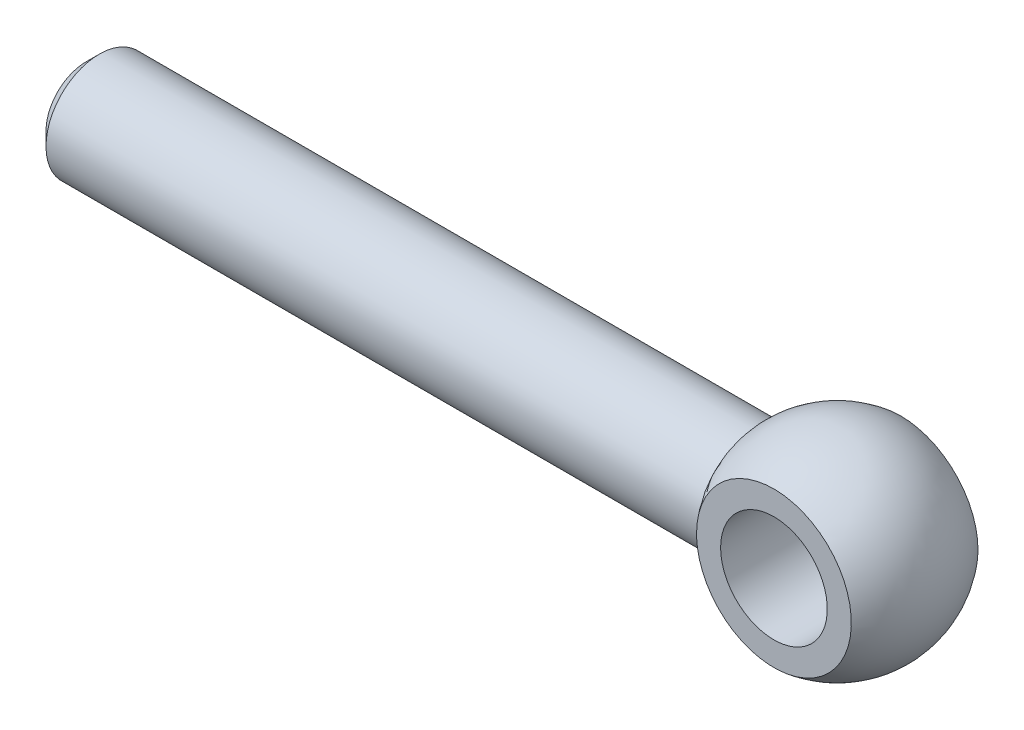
ISO-10303-21;
HEADER;
FILE_DESCRIPTION(('STEP AP214'),'2;1');
FILE_NAME('part.step','',(''),(''),'','','');
FILE_SCHEMA(('AUTOMOTIVE_DESIGN { 1 0 10303 214 1 1 1 1 }'));
ENDSEC;
DATA;
#1=APPLICATION_CONTEXT('core data for automotive mechanical design processes');
#2=APPLICATION_PROTOCOL_DEFINITION('international standard','automotive_design',2000,#1);
#3=PRODUCT_CONTEXT('',#1,'mechanical');
#4=PRODUCT('Part','Part','',(#3));
#5=PRODUCT_RELATED_PRODUCT_CATEGORY('part','',(#4));
#6=PRODUCT_DEFINITION_FORMATION('','',#4);
#7=PRODUCT_DEFINITION_CONTEXT('part definition',#1,'design');
#8=PRODUCT_DEFINITION('design','',#6,#7);
#9=PRODUCT_DEFINITION_SHAPE('','',#8);
#10=(LENGTH_UNIT() NAMED_UNIT(*) SI_UNIT(.MILLI.,.METRE.));
#11=(NAMED_UNIT(*) PLANE_ANGLE_UNIT() SI_UNIT($,.RADIAN.));
#12=(NAMED_UNIT(*) SI_UNIT($,.STERADIAN.) SOLID_ANGLE_UNIT());
#13=UNCERTAINTY_MEASURE_WITH_UNIT(LENGTH_MEASURE(1.E-05),#10,'distance_accuracy_value','');
#14=(GEOMETRIC_REPRESENTATION_CONTEXT(3) GLOBAL_UNCERTAINTY_ASSIGNED_CONTEXT((#13)) GLOBAL_UNIT_ASSIGNED_CONTEXT((#10,
#11,#12)) REPRESENTATION_CONTEXT('',''));
#15=CARTESIAN_POINT('',(0.,0.,0.));
#16=DIRECTION('',(0.,0.,1.));
#17=DIRECTION('',(1.,0.,0.));
#18=AXIS2_PLACEMENT_3D('',#15,#16,#17);
#19=CARTESIAN_POINT('',(-5.804093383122,9.,-4.75));
#20=DIRECTION('',(0.,0.,1.));
#21=DIRECTION('',(1.,0.,0.));
#22=AXIS2_PLACEMENT_3D('',#19,#20,#21);
#23=PLANE('',#22);
#24=CARTESIAN_POINT('',(5.80409338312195,0.,-4.75));
#25=CARTESIAN_POINT('',(5.80409248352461,0.16296057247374,-4.74999999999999));
#26=CARTESIAN_POINT('',(5.7972245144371,0.325950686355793,-4.75));
#27=CARTESIAN_POINT('',(5.76979515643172,0.650807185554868,-4.75));
#28=CARTESIAN_POINT('',(5.74922972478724,0.812673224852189,-4.75));
#29=CARTESIAN_POINT('',(5.69450483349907,1.13436026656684,-4.75));
#30=CARTESIAN_POINT('',(5.66032379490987,1.29417760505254,-4.75));
#31=CARTESIAN_POINT('',(5.5785777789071,1.610489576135,-4.75));
#32=CARTESIAN_POINT('',(5.53100194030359,1.76698140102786,-4.74999999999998));
#33=CARTESIAN_POINT('',(5.422910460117,2.07512781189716,-4.74999999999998));
#34=CARTESIAN_POINT('',(5.36241723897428,2.22679026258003,-4.75));
#35=CARTESIAN_POINT('',(5.22884216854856,2.52454893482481,-4.75));
#36=CARTESIAN_POINT('',(5.15575463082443,2.67064260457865,-4.75));
#37=CARTESIAN_POINT('',(4.99752666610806,2.95615745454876,-4.75));
#38=CARTESIAN_POINT('',(4.91238578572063,3.09557838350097,-4.75));
#39=CARTESIAN_POINT('',(4.73069993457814,3.36668884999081,-4.75));
#40=CARTESIAN_POINT('',(4.63416013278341,3.49838185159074,-4.74999999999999));
#41=CARTESIAN_POINT('',(4.43026574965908,3.75325130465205,-4.74999999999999));
#42=CARTESIAN_POINT('',(4.32290422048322,3.87642219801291,-4.75));
#43=CARTESIAN_POINT('',(4.09829087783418,4.11316309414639,-4.75));
#44=CARTESIAN_POINT('',(3.9810486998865,4.22674223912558,-4.75));
#45=CARTESIAN_POINT('',(3.7373622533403,4.44367484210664,-4.75));
#46=CARTESIAN_POINT('',(3.61091384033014,4.54702364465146,-4.75));
#47=CARTESIAN_POINT('',(3.3497304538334,4.7427250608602,-4.75));
#48=CARTESIAN_POINT('',(3.21499356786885,4.83507512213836,-4.75));
#49=CARTESIAN_POINT('',(2.93826469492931,5.00806526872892,-4.75));
#50=CARTESIAN_POINT('',(2.79627517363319,5.08870929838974,-4.75));
#51=CARTESIAN_POINT('',(2.50595468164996,5.23777890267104,-4.75));
#52=CARTESIAN_POINT('',(2.3576213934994,5.30619996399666,-4.75));
#53=CARTESIAN_POINT('',(2.05577501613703,5.43027674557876,-4.75));
#54=CARTESIAN_POINT('',(1.90226392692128,5.48593733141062,-4.75));
#55=CARTESIAN_POINT('',(1.59104081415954,5.58414947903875,-4.75));
#56=CARTESIAN_POINT('',(1.43332723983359,5.62669612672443,-4.75));
#57=CARTESIAN_POINT('',(1.11494114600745,5.69833492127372,-4.75));
#58=CARTESIAN_POINT('',(0.954269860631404,5.7274325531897,-4.75));
#59=CARTESIAN_POINT('',(0.630974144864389,5.7720022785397,-4.75));
#60=CARTESIAN_POINT('',(0.468348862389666,5.78746819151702,-4.75));
#61=CARTESIAN_POINT('',(0.142373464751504,5.80464198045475,-4.75));
#62=CARTESIAN_POINT('',(-0.0209766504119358,5.80634985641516,-4.75));
#63=CARTESIAN_POINT('',(-0.347165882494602,5.79599779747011,-4.75));
#64=CARTESIAN_POINT('',(-0.510005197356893,5.78394409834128,-4.75));
#65=CARTESIAN_POINT('',(-0.834156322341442,5.74615693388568,-4.75));
#66=CARTESIAN_POINT('',(-0.995467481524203,5.72041788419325,-4.75));
#67=CARTESIAN_POINT('',(-1.31528752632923,5.65545180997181,-4.75));
#68=CARTESIAN_POINT('',(-1.47379743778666,5.61622983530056,-4.75));
#69=CARTESIAN_POINT('',(-1.78701043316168,5.52455703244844,-4.75));
#70=CARTESIAN_POINT('',(-1.94171203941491,5.47210115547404,-4.75));
#71=CARTESIAN_POINT('',(-2.24608912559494,5.35436278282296,-4.75));
#72=CARTESIAN_POINT('',(-2.3957664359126,5.28908501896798,-4.75));
#73=CARTESIAN_POINT('',(-2.6891406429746,5.14613035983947,-4.75));
#74=CARTESIAN_POINT('',(-2.83283550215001,5.06844928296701,-4.75));
#75=CARTESIAN_POINT('',(-3.11313671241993,4.90127560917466,-4.75));
#76=CARTESIAN_POINT('',(-3.24974469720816,4.81178575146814,-4.75));
#77=CARTESIAN_POINT('',(-3.51487673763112,4.62165989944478,-4.75));
#78=CARTESIAN_POINT('',(-3.64340442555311,4.521028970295,-4.75));
#79=CARTESIAN_POINT('',(-3.8916503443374,4.30920033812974,-4.75));
#80=CARTESIAN_POINT('',(-4.01135995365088,4.19799253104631,-4.75));
#81=CARTESIAN_POINT('',(-4.24090650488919,3.96595861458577,-4.75));
#82=CARTESIAN_POINT('',(-4.35074977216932,3.84513876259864,-4.75));
#83=CARTESIAN_POINT('',(-4.55991729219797,3.59462013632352,-4.75));
#84=CARTESIAN_POINT('',(-4.65923676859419,3.46491737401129,-4.75));
#85=CARTESIAN_POINT('',(-4.84658983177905,3.19760922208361,-4.75));
#86=CARTESIAN_POINT('',(-4.93462384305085,3.06000412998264,-4.75));
#87=CARTESIAN_POINT('',(-5.09874703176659,2.77792948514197,-4.75));
#88=CARTESIAN_POINT('',(-5.17484159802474,2.63346306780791,-4.75));
#89=CARTESIAN_POINT('',(-5.31471378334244,2.3383804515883,-4.75));
#90=CARTESIAN_POINT('',(-5.3784699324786,2.1877540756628,-4.75));
#91=CARTESIAN_POINT('',(-5.49300051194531,1.88178280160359,-4.75));
#92=CARTESIAN_POINT('',(-5.54378544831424,1.72644183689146,-4.75));
#93=CARTESIAN_POINT('',(-5.63200928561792,1.41228595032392,-4.75));
#94=CARTESIAN_POINT('',(-5.66946926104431,1.25347693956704,-4.75000000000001));
#95=CARTESIAN_POINT('',(-5.73088170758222,0.933301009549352,-4.74999999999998));
#96=CARTESIAN_POINT('',(-5.75483816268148,0.771934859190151,-4.74999999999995));
#97=CARTESIAN_POINT('',(-5.78266423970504,0.508598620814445,-4.74999999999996));
#98=CARTESIAN_POINT('',(-5.79069765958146,0.407050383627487,-4.74999999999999));
#99=CARTESIAN_POINT('',(-5.8014125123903,0.203671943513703,-4.75000000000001));
#100=CARTESIAN_POINT('',(-5.80409394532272,0.101841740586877,-4.75));
#101=CARTESIAN_POINT('',(-5.80409248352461,-0.162960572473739,-4.75));
#102=CARTESIAN_POINT('',(-5.7972245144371,-0.325950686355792,-4.75));
#103=CARTESIAN_POINT('',(-5.76979515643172,-0.650807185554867,-4.75));
#104=CARTESIAN_POINT('',(-5.74922972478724,-0.812673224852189,-4.75));
#105=CARTESIAN_POINT('',(-5.69450483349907,-1.13436026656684,-4.75));
#106=CARTESIAN_POINT('',(-5.66032379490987,-1.29417760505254,-4.75));
#107=CARTESIAN_POINT('',(-5.5785777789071,-1.610489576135,-4.75));
#108=CARTESIAN_POINT('',(-5.5310019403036,-1.76698140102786,-4.74999999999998));
#109=CARTESIAN_POINT('',(-5.42291046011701,-2.07512781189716,-4.74999999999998));
#110=CARTESIAN_POINT('',(-5.36241723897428,-2.22679026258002,-4.75));
#111=CARTESIAN_POINT('',(-5.22884216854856,-2.5245489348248,-4.75));
#112=CARTESIAN_POINT('',(-5.15575463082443,-2.67064260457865,-4.75));
#113=CARTESIAN_POINT('',(-4.99752666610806,-2.95615745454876,-4.75));
#114=CARTESIAN_POINT('',(-4.91238578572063,-3.09557838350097,-4.75));
#115=CARTESIAN_POINT('',(-4.73069993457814,-3.3666888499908,-4.75));
#116=CARTESIAN_POINT('',(-4.63416013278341,-3.49838185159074,-4.74999999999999));
#117=CARTESIAN_POINT('',(-4.43026574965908,-3.75325130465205,-4.74999999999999));
#118=CARTESIAN_POINT('',(-4.32290422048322,-3.87642219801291,-4.75));
#119=CARTESIAN_POINT('',(-4.09829087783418,-4.11316309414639,-4.75));
#120=CARTESIAN_POINT('',(-3.9810486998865,-4.22674223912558,-4.75));
#121=CARTESIAN_POINT('',(-3.7373622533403,-4.44367484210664,-4.75));
#122=CARTESIAN_POINT('',(-3.61091384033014,-4.54702364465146,-4.75));
#123=CARTESIAN_POINT('',(-3.34973045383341,-4.7427250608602,-4.75));
#124=CARTESIAN_POINT('',(-3.21499356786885,-4.83507512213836,-4.75));
#125=CARTESIAN_POINT('',(-2.93826469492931,-5.00806526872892,-4.75));
#126=CARTESIAN_POINT('',(-2.7962751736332,-5.08870929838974,-4.75));
#127=CARTESIAN_POINT('',(-2.50595468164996,-5.23777890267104,-4.75));
#128=CARTESIAN_POINT('',(-2.3576213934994,-5.30619996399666,-4.75));
#129=CARTESIAN_POINT('',(-2.05577501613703,-5.43027674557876,-4.75));
#130=CARTESIAN_POINT('',(-1.90226392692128,-5.48593733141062,-4.75));
#131=CARTESIAN_POINT('',(-1.59104081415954,-5.58414947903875,-4.75));
#132=CARTESIAN_POINT('',(-1.4333272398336,-5.62669612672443,-4.75));
#133=CARTESIAN_POINT('',(-1.11494114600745,-5.69833492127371,-4.75));
#134=CARTESIAN_POINT('',(-0.954269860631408,-5.7274325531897,-4.75));
#135=CARTESIAN_POINT('',(-0.630974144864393,-5.7720022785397,-4.75));
#136=CARTESIAN_POINT('',(-0.46834886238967,-5.78746819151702,-4.75));
#137=CARTESIAN_POINT('',(-0.142373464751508,-5.80464198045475,-4.75));
#138=CARTESIAN_POINT('',(0.0209766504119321,-5.80634985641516,-4.75));
#139=CARTESIAN_POINT('',(0.347165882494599,-5.79599779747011,-4.75));
#140=CARTESIAN_POINT('',(0.510005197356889,-5.78394409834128,-4.75));
#141=CARTESIAN_POINT('',(0.83415632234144,-5.74615693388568,-4.75));
#142=CARTESIAN_POINT('',(0.9954674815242,-5.72041788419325,-4.75));
#143=CARTESIAN_POINT('',(1.31528752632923,-5.65545180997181,-4.75));
#144=CARTESIAN_POINT('',(1.47379743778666,-5.61622983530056,-4.75));
#145=CARTESIAN_POINT('',(1.78701043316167,-5.52455703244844,-4.75));
#146=CARTESIAN_POINT('',(1.94171203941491,-5.47210115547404,-4.75));
#147=CARTESIAN_POINT('',(2.24608912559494,-5.35436278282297,-4.75));
#148=CARTESIAN_POINT('',(2.3957664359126,-5.28908501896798,-4.75));
#149=CARTESIAN_POINT('',(2.6891406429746,-5.14613035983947,-4.75));
#150=CARTESIAN_POINT('',(2.83283550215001,-5.06844928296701,-4.75));
#151=CARTESIAN_POINT('',(3.11313671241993,-4.90127560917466,-4.75));
#152=CARTESIAN_POINT('',(3.24974469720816,-4.81178575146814,-4.75));
#153=CARTESIAN_POINT('',(3.51487673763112,-4.62165989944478,-4.75));
#154=CARTESIAN_POINT('',(3.64340442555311,-4.521028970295,-4.75));
#155=CARTESIAN_POINT('',(3.8916503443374,-4.30920033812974,-4.75));
#156=CARTESIAN_POINT('',(4.01135995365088,-4.19799253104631,-4.75));
#157=CARTESIAN_POINT('',(4.24090650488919,-3.96595861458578,-4.75));
#158=CARTESIAN_POINT('',(4.35074977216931,-3.84513876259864,-4.75));
#159=CARTESIAN_POINT('',(4.55991729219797,-3.59462013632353,-4.75));
#160=CARTESIAN_POINT('',(4.65923676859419,-3.46491737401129,-4.75));
#161=CARTESIAN_POINT('',(4.84658983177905,-3.19760922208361,-4.75));
#162=CARTESIAN_POINT('',(4.93462384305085,-3.06000412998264,-4.75));
#163=CARTESIAN_POINT('',(5.09874703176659,-2.77792948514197,-4.75));
#164=CARTESIAN_POINT('',(5.17484159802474,-2.63346306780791,-4.75));
#165=CARTESIAN_POINT('',(5.31471378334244,-2.33838045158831,-4.75));
#166=CARTESIAN_POINT('',(5.3784699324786,-2.1877540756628,-4.75));
#167=CARTESIAN_POINT('',(5.49300051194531,-1.88178280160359,-4.75));
#168=CARTESIAN_POINT('',(5.54378544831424,-1.72644183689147,-4.75));
#169=CARTESIAN_POINT('',(5.63200928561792,-1.41228595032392,-4.75));
#170=CARTESIAN_POINT('',(5.66946926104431,-1.25347693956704,-4.75000000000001));
#171=CARTESIAN_POINT('',(5.73088170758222,-0.933301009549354,-4.74999999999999));
#172=CARTESIAN_POINT('',(5.75483816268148,-0.771934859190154,-4.74999999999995));
#173=CARTESIAN_POINT('',(5.78266423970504,-0.508598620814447,-4.74999999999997));
#174=CARTESIAN_POINT('',(5.79069765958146,-0.407050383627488,-4.74999999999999));
#175=CARTESIAN_POINT('',(5.8014125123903,-0.203671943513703,-4.75000000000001));
#176=CARTESIAN_POINT('',(5.80409394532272,-0.101841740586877,-4.75));
#177=CARTESIAN_POINT('',(5.80409338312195,0.,-4.75));
#178=B_SPLINE_CURVE_WITH_KNOTS('',3,(#24,#25,#26,#27,#28,#29,#30,#31,#32,#33,#34,#35,#36,#37,
#38,#39,#40,#41,#42,#43,#44,#45,#46,#47,#48,#49,#50,#51,#52,#53,#54,#55,#56,#57,#58,#59,#60,#61,
#62,#63,#64,#65,#66,#67,#68,#69,#70,#71,#72,#73,#74,#75,#76,#77,#78,#79,#80,#81,#82,#83,#84,#85,
#86,#87,#88,#89,#90,#91,#92,#93,#94,#95,#96,#97,#98,#99,#100,#101,#102,#103,#104,#105,#106,#107,
#108,#109,#110,#111,#112,#113,#114,#115,#116,#117,#118,#119,#120,#121,#122,#123,#124,#125,#126,
#127,#128,#129,#130,#131,#132,#133,#134,#135,#136,#137,#138,#139,#140,#141,#142,#143,#144,#145,
#146,#147,#148,#149,#150,#151,#152,#153,#154,#155,#156,#157,#158,#159,#160,#161,#162,#163,#164,
#165,#166,#167,#168,#169,#170,#171,#172,#173,#174,#175,#176,#177),.UNSPECIFIED.,.T.,.F.,(4,2,2,
2,2,2,2,2,2,2,2,2,2,2,2,2,2,2,2,2,2,2,2,2,2,2,2,2,2,2,2,2,2,2,2,2,2,2,2,2,2,2,2,2,2,2,2,2,2,2,2,
2,2,2,2,2,2,2,2,2,2,2,2,2,2,2,2,2,2,2,2,2,2,2,2,2,4),(0.,0.488788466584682,0.97772126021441,
1.46743205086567,1.95754107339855,2.44680623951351,2.93629297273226,3.42579812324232,
3.91508214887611,4.4046823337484,4.89381047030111,5.38316017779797,5.87262322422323,
6.36192096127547,6.85139899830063,7.34069008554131,7.8301642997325,8.31943871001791,
8.80893483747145,9.29843096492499,9.7877053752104,10.2771795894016,10.7664706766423,
11.2559487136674,11.7452464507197,12.2347094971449,12.7240592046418,13.2131873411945,
13.7027875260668,14.1920715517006,14.6815767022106,15.1710634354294,15.6603286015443,
16.1504376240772,16.6401484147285,17.1290812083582,17.6178696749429,17.9233366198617,
18.2288035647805,18.7175920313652,19.2065248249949,19.6962356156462,20.1863446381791,
20.675609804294,21.1650965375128,21.6546016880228,22.1438857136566,22.6334858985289,
23.1226140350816,23.6119637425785,24.1014267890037,24.590724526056,25.0802025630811,
25.5694936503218,26.058967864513,26.5482422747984,27.037738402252,27.5272345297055,
28.0165089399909,28.5059831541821,28.9952742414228,29.4847522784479,29.9740500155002,
30.4635130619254,30.9528627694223,31.441990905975,31.9315910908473,32.4208751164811,
32.9103802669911,33.3998670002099,33.8891321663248,34.3792411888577,34.868951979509,
35.3578847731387,35.8466732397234,36.1521401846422,36.457607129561),.UNSPECIFIED.);
#179=CARTESIAN_POINT('',(5.80409338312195,0.,-4.75));
#180=VERTEX_POINT('',#179);
#181=EDGE_CURVE('E73',#180,#180,#178,.T.);
#182=ORIENTED_EDGE('',*,*,#181,.F.);
#183=EDGE_LOOP('',(#182));
#184=FACE_BOUND('',#183,.T.);
#185=CARTESIAN_POINT('',(0.,0.,-4.75));
#186=DIRECTION('',(0.,0.,-1.));
#187=DIRECTION('',(-1.,0.,0.));
#188=AXIS2_PLACEMENT_3D('',#185,#186,#187);
#189=CIRCLE('',#188,3.99999999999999);
#190=CARTESIAN_POINT('',(-3.99999999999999,0.,-4.75));
#191=VERTEX_POINT('',#190);
#192=EDGE_CURVE('E109',#191,#191,#189,.T.);
#193=ORIENTED_EDGE('',*,*,#192,.F.);
#194=EDGE_LOOP('',(#193));
#195=FACE_BOUND('',#194,.T.);
#196=ADVANCED_FACE('F50',(#184,#195),#23,.F.);
#197=CARTESIAN_POINT('',(5.804093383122,9.,4.75));
#198=DIRECTION('',(0.,0.,-1.));
#199=DIRECTION('',(-1.,0.,0.));
#200=AXIS2_PLACEMENT_3D('',#197,#198,#199);
#201=PLANE('',#200);
#202=CARTESIAN_POINT('',(0.,0.,4.75));
#203=DIRECTION('',(0.,0.,-1.));
#204=DIRECTION('',(-1.,0.,0.));
#205=AXIS2_PLACEMENT_3D('',#202,#203,#204);
#206=CIRCLE('',#205,3.99999999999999);
#207=CARTESIAN_POINT('',(-3.99999999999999,0.,4.75));
#208=VERTEX_POINT('',#207);
#209=EDGE_CURVE('E88',#208,#208,#206,.T.);
#210=ORIENTED_EDGE('',*,*,#209,.T.);
#211=EDGE_LOOP('',(#210));
#212=FACE_BOUND('',#211,.T.);
#213=CARTESIAN_POINT('',(-5.80409338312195,0.,4.75));
#214=CARTESIAN_POINT('',(-5.80409248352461,0.16296057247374,4.74999999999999));
#215=CARTESIAN_POINT('',(-5.7972245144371,0.325950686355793,4.75));
#216=CARTESIAN_POINT('',(-5.76979515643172,0.650807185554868,4.75));
#217=CARTESIAN_POINT('',(-5.74922972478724,0.81267322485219,4.75));
#218=CARTESIAN_POINT('',(-5.69450483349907,1.13436026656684,4.75));
#219=CARTESIAN_POINT('',(-5.66032379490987,1.29417760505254,4.75));
#220=CARTESIAN_POINT('',(-5.5785777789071,1.610489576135,4.75));
#221=CARTESIAN_POINT('',(-5.53100194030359,1.76698140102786,4.74999999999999));
#222=CARTESIAN_POINT('',(-5.422910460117,2.07512781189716,4.74999999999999));
#223=CARTESIAN_POINT('',(-5.36241723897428,2.22679026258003,4.75));
#224=CARTESIAN_POINT('',(-5.22884216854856,2.52454893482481,4.75));
#225=CARTESIAN_POINT('',(-5.15575463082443,2.67064260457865,4.75));
#226=CARTESIAN_POINT('',(-4.99752666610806,2.95615745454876,4.75));
#227=CARTESIAN_POINT('',(-4.91238578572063,3.09557838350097,4.75));
#228=CARTESIAN_POINT('',(-4.73069993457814,3.36668884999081,4.75));
#229=CARTESIAN_POINT('',(-4.63416013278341,3.49838185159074,4.74999999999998));
#230=CARTESIAN_POINT('',(-4.43026574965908,3.75325130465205,4.74999999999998));
#231=CARTESIAN_POINT('',(-4.32290422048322,3.87642219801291,4.75));
#232=CARTESIAN_POINT('',(-4.09829087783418,4.11316309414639,4.75));
#233=CARTESIAN_POINT('',(-3.9810486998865,4.22674223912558,4.75));
#234=CARTESIAN_POINT('',(-3.7373622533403,4.44367484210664,4.75));
#235=CARTESIAN_POINT('',(-3.61091384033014,4.54702364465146,4.75));
#236=CARTESIAN_POINT('',(-3.3497304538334,4.7427250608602,4.75));
#237=CARTESIAN_POINT('',(-3.21499356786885,4.83507512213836,4.75000000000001));
#238=CARTESIAN_POINT('',(-2.93826469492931,5.00806526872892,4.75000000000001));
#239=CARTESIAN_POINT('',(-2.79627517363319,5.08870929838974,4.75));
#240=CARTESIAN_POINT('',(-2.50595468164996,5.23777890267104,4.75));
#241=CARTESIAN_POINT('',(-2.3576213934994,5.30619996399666,4.75));
#242=CARTESIAN_POINT('',(-2.05577501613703,5.43027674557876,4.75));
#243=CARTESIAN_POINT('',(-1.90226392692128,5.48593733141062,4.75));
#244=CARTESIAN_POINT('',(-1.59104081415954,5.58414947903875,4.75));
#245=CARTESIAN_POINT('',(-1.43332723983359,5.62669612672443,4.75));
#246=CARTESIAN_POINT('',(-1.11494114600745,5.69833492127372,4.75));
#247=CARTESIAN_POINT('',(-0.954269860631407,5.7274325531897,4.75));
#248=CARTESIAN_POINT('',(-0.630974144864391,5.7720022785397,4.75));
#249=CARTESIAN_POINT('',(-0.468348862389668,5.78746819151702,4.75));
#250=CARTESIAN_POINT('',(-0.142373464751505,5.80464198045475,4.75));
#251=CARTESIAN_POINT('',(0.0209766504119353,5.80634985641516,4.75));
#252=CARTESIAN_POINT('',(0.347165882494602,5.79599779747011,4.75));
#253=CARTESIAN_POINT('',(0.510005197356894,5.78394409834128,4.75));
#254=CARTESIAN_POINT('',(0.834156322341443,5.74615693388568,4.75));
#255=CARTESIAN_POINT('',(0.995467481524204,5.72041788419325,4.75));
#256=CARTESIAN_POINT('',(1.31528752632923,5.65545180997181,4.75));
#257=CARTESIAN_POINT('',(1.47379743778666,5.61622983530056,4.75));
#258=CARTESIAN_POINT('',(1.78701043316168,5.52455703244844,4.75));
#259=CARTESIAN_POINT('',(1.94171203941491,5.47210115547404,4.75));
#260=CARTESIAN_POINT('',(2.24608912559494,5.35436278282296,4.75));
#261=CARTESIAN_POINT('',(2.3957664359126,5.28908501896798,4.75));
#262=CARTESIAN_POINT('',(2.6891406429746,5.14613035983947,4.75));
#263=CARTESIAN_POINT('',(2.83283550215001,5.06844928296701,4.75));
#264=CARTESIAN_POINT('',(3.11313671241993,4.90127560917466,4.75));
#265=CARTESIAN_POINT('',(3.24974469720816,4.81178575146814,4.75));
#266=CARTESIAN_POINT('',(3.51487673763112,4.62165989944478,4.75));
#267=CARTESIAN_POINT('',(3.64340442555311,4.521028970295,4.75));
#268=CARTESIAN_POINT('',(3.8916503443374,4.30920033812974,4.75));
#269=CARTESIAN_POINT('',(4.01135995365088,4.19799253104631,4.75));
#270=CARTESIAN_POINT('',(4.24090650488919,3.96595861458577,4.75));
#271=CARTESIAN_POINT('',(4.35074977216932,3.84513876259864,4.75));
#272=CARTESIAN_POINT('',(4.55991729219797,3.59462013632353,4.75));
#273=CARTESIAN_POINT('',(4.65923676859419,3.46491737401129,4.75));
#274=CARTESIAN_POINT('',(4.84658983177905,3.19760922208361,4.75));
#275=CARTESIAN_POINT('',(4.93462384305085,3.06000412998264,4.75));
#276=CARTESIAN_POINT('',(5.09874703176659,2.77792948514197,4.75));
#277=CARTESIAN_POINT('',(5.17484159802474,2.63346306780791,4.75));
#278=CARTESIAN_POINT('',(5.31471378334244,2.3383804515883,4.75));
#279=CARTESIAN_POINT('',(5.3784699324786,2.1877540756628,4.75));
#280=CARTESIAN_POINT('',(5.49300051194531,1.88178280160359,4.75));
#281=CARTESIAN_POINT('',(5.54378544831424,1.72644183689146,4.75));
#282=CARTESIAN_POINT('',(5.63200928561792,1.41228595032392,4.75));
#283=CARTESIAN_POINT('',(5.66946926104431,1.25347693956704,4.75000000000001));
#284=CARTESIAN_POINT('',(5.73088170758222,0.933301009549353,4.74999999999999));
#285=CARTESIAN_POINT('',(5.75483816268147,0.771934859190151,4.74999999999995));
#286=CARTESIAN_POINT('',(5.78266423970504,0.508598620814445,4.74999999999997));
#287=CARTESIAN_POINT('',(5.79069765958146,0.407050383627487,4.74999999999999));
#288=CARTESIAN_POINT('',(5.8014125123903,0.203671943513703,4.75000000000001));
#289=CARTESIAN_POINT('',(5.80409394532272,0.101841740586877,4.75));
#290=CARTESIAN_POINT('',(5.80409248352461,-0.162960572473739,4.75));
#291=CARTESIAN_POINT('',(5.7972245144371,-0.325950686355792,4.75));
#292=CARTESIAN_POINT('',(5.76979515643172,-0.650807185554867,4.75));
#293=CARTESIAN_POINT('',(5.74922972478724,-0.812673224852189,4.75));
#294=CARTESIAN_POINT('',(5.69450483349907,-1.13436026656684,4.75));
#295=CARTESIAN_POINT('',(5.66032379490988,-1.29417760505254,4.75));
#296=CARTESIAN_POINT('',(5.5785777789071,-1.610489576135,4.75));
#297=CARTESIAN_POINT('',(5.5310019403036,-1.76698140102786,4.74999999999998));
#298=CARTESIAN_POINT('',(5.422910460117,-2.07512781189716,4.74999999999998));
#299=CARTESIAN_POINT('',(5.36241723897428,-2.22679026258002,4.75));
#300=CARTESIAN_POINT('',(5.22884216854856,-2.5245489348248,4.75));
#301=CARTESIAN_POINT('',(5.15575463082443,-2.67064260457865,4.75));
#302=CARTESIAN_POINT('',(4.99752666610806,-2.95615745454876,4.75));
#303=CARTESIAN_POINT('',(4.91238578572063,-3.09557838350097,4.75));
#304=CARTESIAN_POINT('',(4.73069993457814,-3.3666888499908,4.75));
#305=CARTESIAN_POINT('',(4.63416013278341,-3.49838185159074,4.74999999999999));
#306=CARTESIAN_POINT('',(4.43026574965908,-3.75325130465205,4.74999999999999));
#307=CARTESIAN_POINT('',(4.32290422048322,-3.87642219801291,4.75));
#308=CARTESIAN_POINT('',(4.09829087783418,-4.11316309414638,4.75));
#309=CARTESIAN_POINT('',(3.9810486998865,-4.22674223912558,4.75));
#310=CARTESIAN_POINT('',(3.7373622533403,-4.44367484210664,4.75));
#311=CARTESIAN_POINT('',(3.61091384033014,-4.54702364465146,4.75));
#312=CARTESIAN_POINT('',(3.34973045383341,-4.7427250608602,4.75));
#313=CARTESIAN_POINT('',(3.21499356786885,-4.83507512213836,4.75));
#314=CARTESIAN_POINT('',(2.93826469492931,-5.00806526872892,4.75));
#315=CARTESIAN_POINT('',(2.7962751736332,-5.08870929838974,4.75));
#316=CARTESIAN_POINT('',(2.50595468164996,-5.23777890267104,4.75));
#317=CARTESIAN_POINT('',(2.3576213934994,-5.30619996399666,4.75));
#318=CARTESIAN_POINT('',(2.05577501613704,-5.43027674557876,4.75));
#319=CARTESIAN_POINT('',(1.90226392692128,-5.48593733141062,4.75));
#320=CARTESIAN_POINT('',(1.59104081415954,-5.58414947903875,4.75));
#321=CARTESIAN_POINT('',(1.4333272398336,-5.62669612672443,4.75));
#322=CARTESIAN_POINT('',(1.11494114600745,-5.69833492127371,4.75));
#323=CARTESIAN_POINT('',(0.954269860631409,-5.7274325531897,4.75));
#324=CARTESIAN_POINT('',(0.630974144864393,-5.7720022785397,4.75));
#325=CARTESIAN_POINT('',(0.46834886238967,-5.78746819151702,4.75));
#326=CARTESIAN_POINT('',(0.142373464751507,-5.80464198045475,4.75));
#327=CARTESIAN_POINT('',(-0.0209766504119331,-5.80634985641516,4.75));
#328=CARTESIAN_POINT('',(-0.3471658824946,-5.79599779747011,4.75));
#329=CARTESIAN_POINT('',(-0.510005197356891,-5.78394409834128,4.75));
#330=CARTESIAN_POINT('',(-0.834156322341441,-5.74615693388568,4.75));
#331=CARTESIAN_POINT('',(-0.995467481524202,-5.72041788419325,4.75));
#332=CARTESIAN_POINT('',(-1.31528752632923,-5.65545180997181,4.75));
#333=CARTESIAN_POINT('',(-1.47379743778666,-5.61622983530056,4.75));
#334=CARTESIAN_POINT('',(-1.78701043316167,-5.52455703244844,4.75));
#335=CARTESIAN_POINT('',(-1.94171203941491,-5.47210115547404,4.75));
#336=CARTESIAN_POINT('',(-2.24608912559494,-5.35436278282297,4.75));
#337=CARTESIAN_POINT('',(-2.39576643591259,-5.28908501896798,4.75));
#338=CARTESIAN_POINT('',(-2.6891406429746,-5.14613035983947,4.75));
#339=CARTESIAN_POINT('',(-2.83283550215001,-5.06844928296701,4.75));
#340=CARTESIAN_POINT('',(-3.11313671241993,-4.90127560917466,4.75));
#341=CARTESIAN_POINT('',(-3.24974469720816,-4.81178575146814,4.75));
#342=CARTESIAN_POINT('',(-3.51487673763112,-4.62165989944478,4.75));
#343=CARTESIAN_POINT('',(-3.64340442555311,-4.521028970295,4.75));
#344=CARTESIAN_POINT('',(-3.8916503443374,-4.30920033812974,4.75));
#345=CARTESIAN_POINT('',(-4.01135995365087,-4.19799253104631,4.75));
#346=CARTESIAN_POINT('',(-4.24090650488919,-3.96595861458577,4.75));
#347=CARTESIAN_POINT('',(-4.35074977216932,-3.84513876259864,4.75));
#348=CARTESIAN_POINT('',(-4.55991729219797,-3.59462013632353,4.75));
#349=CARTESIAN_POINT('',(-4.65923676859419,-3.46491737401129,4.75));
#350=CARTESIAN_POINT('',(-4.84658983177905,-3.19760922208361,4.75));
#351=CARTESIAN_POINT('',(-4.93462384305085,-3.06000412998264,4.75));
#352=CARTESIAN_POINT('',(-5.09874703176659,-2.77792948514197,4.75));
#353=CARTESIAN_POINT('',(-5.17484159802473,-2.63346306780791,4.75));
#354=CARTESIAN_POINT('',(-5.31471378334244,-2.33838045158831,4.75));
#355=CARTESIAN_POINT('',(-5.3784699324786,-2.1877540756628,4.75));
#356=CARTESIAN_POINT('',(-5.49300051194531,-1.88178280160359,4.75));
#357=CARTESIAN_POINT('',(-5.54378544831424,-1.72644183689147,4.75));
#358=CARTESIAN_POINT('',(-5.63200928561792,-1.41228595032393,4.75));
#359=CARTESIAN_POINT('',(-5.66946926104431,-1.25347693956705,4.75000000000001));
#360=CARTESIAN_POINT('',(-5.73088170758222,-0.933301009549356,4.74999999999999));
#361=CARTESIAN_POINT('',(-5.75483816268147,-0.771934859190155,4.74999999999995));
#362=CARTESIAN_POINT('',(-5.78266423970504,-0.508598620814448,4.74999999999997));
#363=CARTESIAN_POINT('',(-5.79069765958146,-0.407050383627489,4.74999999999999));
#364=CARTESIAN_POINT('',(-5.8014125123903,-0.203671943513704,4.75000000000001));
#365=CARTESIAN_POINT('',(-5.80409394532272,-0.101841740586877,4.75));
#366=CARTESIAN_POINT('',(-5.80409338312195,0.,4.75));
#367=B_SPLINE_CURVE_WITH_KNOTS('',3,(#213,#214,#215,#216,#217,#218,#219,#220,#221,#222,#223,
#224,#225,#226,#227,#228,#229,#230,#231,#232,#233,#234,#235,#236,#237,#238,#239,#240,#241,#242,
#243,#244,#245,#246,#247,#248,#249,#250,#251,#252,#253,#254,#255,#256,#257,#258,#259,#260,#261,
#262,#263,#264,#265,#266,#267,#268,#269,#270,#271,#272,#273,#274,#275,#276,#277,#278,#279,#280,
#281,#282,#283,#284,#285,#286,#287,#288,#289,#290,#291,#292,#293,#294,#295,#296,#297,#298,#299,
#300,#301,#302,#303,#304,#305,#306,#307,#308,#309,#310,#311,#312,#313,#314,#315,#316,#317,#318,
#319,#320,#321,#322,#323,#324,#325,#326,#327,#328,#329,#330,#331,#332,#333,#334,#335,#336,#337,
#338,#339,#340,#341,#342,#343,#344,#345,#346,#347,#348,#349,#350,#351,#352,#353,#354,#355,#356,
#357,#358,#359,#360,#361,#362,#363,#364,#365,#366),.UNSPECIFIED.,.T.,.F.,(4,2,2,2,2,2,2,2,2,2,2,
2,2,2,2,2,2,2,2,2,2,2,2,2,2,2,2,2,2,2,2,2,2,2,2,2,2,2,2,2,2,2,2,2,2,2,2,2,2,2,2,2,2,2,2,2,2,2,2,
2,2,2,2,2,2,2,2,2,2,2,2,2,2,2,2,2,4),(0.,0.488788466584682,0.977721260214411,1.46743205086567,
1.95754107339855,2.44680623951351,2.93629297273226,3.42579812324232,3.91508214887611,
4.4046823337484,4.89381047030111,5.38316017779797,5.87262322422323,6.36192096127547,
6.85139899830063,7.34069008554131,7.8301642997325,8.31943871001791,8.80893483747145,
9.29843096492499,9.7877053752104,10.2771795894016,10.7664706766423,11.2559487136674,
11.7452464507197,12.2347094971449,12.7240592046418,13.2131873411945,13.7027875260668,
14.1920715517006,14.6815767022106,15.1710634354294,15.6603286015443,16.1504376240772,
16.6401484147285,17.1290812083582,17.6178696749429,17.9233366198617,18.2288035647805,
18.7175920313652,19.2065248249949,19.6962356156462,20.1863446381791,20.675609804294,
21.1650965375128,21.6546016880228,22.1438857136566,22.6334858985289,23.1226140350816,
23.6119637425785,24.1014267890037,24.590724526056,25.0802025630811,25.5694936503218,
26.058967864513,26.5482422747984,27.037738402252,27.5272345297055,28.0165089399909,
28.5059831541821,28.9952742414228,29.4847522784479,29.9740500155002,30.4635130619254,
30.9528627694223,31.441990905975,31.9315910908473,32.4208751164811,32.9103802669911,
33.3998670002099,33.8891321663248,34.3792411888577,34.868951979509,35.3578847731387,
35.8466732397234,36.1521401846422,36.457607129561),.UNSPECIFIED.);
#368=CARTESIAN_POINT('',(-5.80409338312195,0.,4.75));
#369=VERTEX_POINT('',#368);
#370=EDGE_CURVE('E80',#369,#369,#367,.T.);
#371=ORIENTED_EDGE('',*,*,#370,.F.);
#372=EDGE_LOOP('',(#371));
#373=FACE_BOUND('',#372,.T.);
#374=ADVANCED_FACE('F67',(#212,#373),#201,.F.);
#375=CARTESIAN_POINT('',(0.,0.,0.));
#376=DIRECTION('',(0.,1.,0.));
#377=DIRECTION('',(0.,0.,-1.));
#378=AXIS2_PLACEMENT_3D('',#375,#376,#377);
#379=SPHERICAL_SURFACE('',#378,7.5);
#380=CARTESIAN_POINT('',(0.,7.5,0.));
#381=VERTEX_POINT('',#380);
#382=VERTEX_LOOP('',#381);
#383=FACE_BOUND('',#382,.T.);
#384=CARTESIAN_POINT('',(0.,-7.5,0.));
#385=VERTEX_POINT('',#384);
#386=VERTEX_LOOP('',#385);
#387=FACE_BOUND('',#386,.T.);
#388=ORIENTED_EDGE('',*,*,#181,.T.);
#389=EDGE_LOOP('',(#388));
#390=FACE_BOUND('',#389,.T.);
#391=CARTESIAN_POINT('',(-6.344288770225,0.,0.));
#392=DIRECTION('',(-1.,0.,0.));
#393=DIRECTION('',(0.,0.,1.));
#394=AXIS2_PLACEMENT_3D('',#391,#392,#393);
#395=CIRCLE('',#394,4.);
#396=CARTESIAN_POINT('',(-6.344288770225,0.,4.));
#397=VERTEX_POINT('',#396);
#398=EDGE_CURVE('E77',#397,#397,#395,.T.);
#399=ORIENTED_EDGE('',*,*,#398,.F.);
#400=EDGE_LOOP('',(#399));
#401=FACE_BOUND('',#400,.T.);
#402=ORIENTED_EDGE('',*,*,#370,.T.);
#403=EDGE_LOOP('',(#402));
#404=FACE_BOUND('',#403,.T.);
#405=ADVANCED_FACE('F64',(#383,#387,#390,#401,#404),#379,.T.);
#406=CARTESIAN_POINT('',(-56.34428877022,0.,0.));
#407=DIRECTION('',(1.,0.,0.));
#408=DIRECTION('',(0.,0.,-1.));
#409=AXIS2_PLACEMENT_3D('',#406,#407,#408);
#410=CYLINDRICAL_SURFACE('',#409,4.);
#411=CARTESIAN_POINT('',(-55.3442887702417,0.,0.));
#412=DIRECTION('',(-1.,0.,0.));
#413=DIRECTION('',(0.,0.,1.));
#414=AXIS2_PLACEMENT_3D('',#411,#412,#413);
#415=CIRCLE('',#414,4.);
#416=CARTESIAN_POINT('',(-55.3442887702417,0.,4.));
#417=VERTEX_POINT('',#416);
#418=EDGE_CURVE('E12',#417,#417,#415,.F.);
#419=ORIENTED_EDGE('',*,*,#418,.T.);
#420=EDGE_LOOP('',(#419));
#421=FACE_BOUND('',#420,.T.);
#422=ORIENTED_EDGE('',*,*,#398,.T.);
#423=EDGE_LOOP('',(#422));
#424=FACE_BOUND('',#423,.T.);
#425=ADVANCED_FACE('F66',(#421,#424),#410,.T.);
#426=CARTESIAN_POINT('',(-56.34428877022,0.,0.));
#427=DIRECTION('',(-1.,0.,0.));
#428=DIRECTION('',(0.,0.,1.));
#429=AXIS2_PLACEMENT_3D('',#426,#427,#428);
#430=PLANE('',#429);
#431=CARTESIAN_POINT('',(-56.34428877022,0.,0.));
#432=DIRECTION('',(-1.,0.,0.));
#433=DIRECTION('',(0.,0.,1.));
#434=AXIS2_PLACEMENT_3D('',#431,#432,#433);
#435=CIRCLE('',#434,2.99999999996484);
#436=CARTESIAN_POINT('',(-56.34428877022,0.,2.99999999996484));
#437=VERTEX_POINT('',#436);
#438=EDGE_CURVE('E59',#437,#437,#435,.T.);
#439=ORIENTED_EDGE('',*,*,#438,.T.);
#440=EDGE_LOOP('',(#439));
#441=FACE_BOUND('',#440,.T.);
#442=ADVANCED_FACE('F127',(#441),#430,.T.);
#443=CARTESIAN_POINT('',(0.,0.,-4.75));
#444=DIRECTION('',(0.,0.,-1.));
#445=DIRECTION('',(-1.,0.,0.));
#446=AXIS2_PLACEMENT_3D('',#443,#444,#445);
#447=CYLINDRICAL_SURFACE('',#446,3.99999999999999);
#448=ORIENTED_EDGE('',*,*,#192,.T.);
#449=EDGE_LOOP('',(#448));
#450=FACE_BOUND('',#449,.T.);
#451=ORIENTED_EDGE('',*,*,#209,.F.);
#452=EDGE_LOOP('',(#451));
#453=FACE_BOUND('',#452,.T.);
#454=ADVANCED_FACE('F113',(#450,#453),#447,.F.);
#455=CARTESIAN_POINT('',(-56.34428877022,0.,0.));
#456=DIRECTION('',(1.,0.,0.));
#457=DIRECTION('',(0.,0.,-1.));
#458=AXIS2_PLACEMENT_3D('',#455,#456,#457);
#459=CONICAL_SURFACE('',#458,2.99999999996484,0.785398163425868);
#460=ORIENTED_EDGE('',*,*,#418,.F.);
#461=EDGE_LOOP('',(#460));
#462=FACE_BOUND('',#461,.T.);
#463=ORIENTED_EDGE('',*,*,#438,.F.);
#464=EDGE_LOOP('',(#463));
#465=FACE_BOUND('',#464,.T.);
#466=ADVANCED_FACE('F52',(#462,#465),#459,.T.);
#467=CLOSED_SHELL('',(#196,#374,#405,#425,#442,#454,#466));
#468=MANIFOLD_SOLID_BREP('B2',#467);
#469=ADVANCED_BREP_SHAPE_REPRESENTATION('',(#18,#468),#14);
#470=SHAPE_DEFINITION_REPRESENTATION(#9,#469);
ENDSEC;
END-ISO-10303-21;
